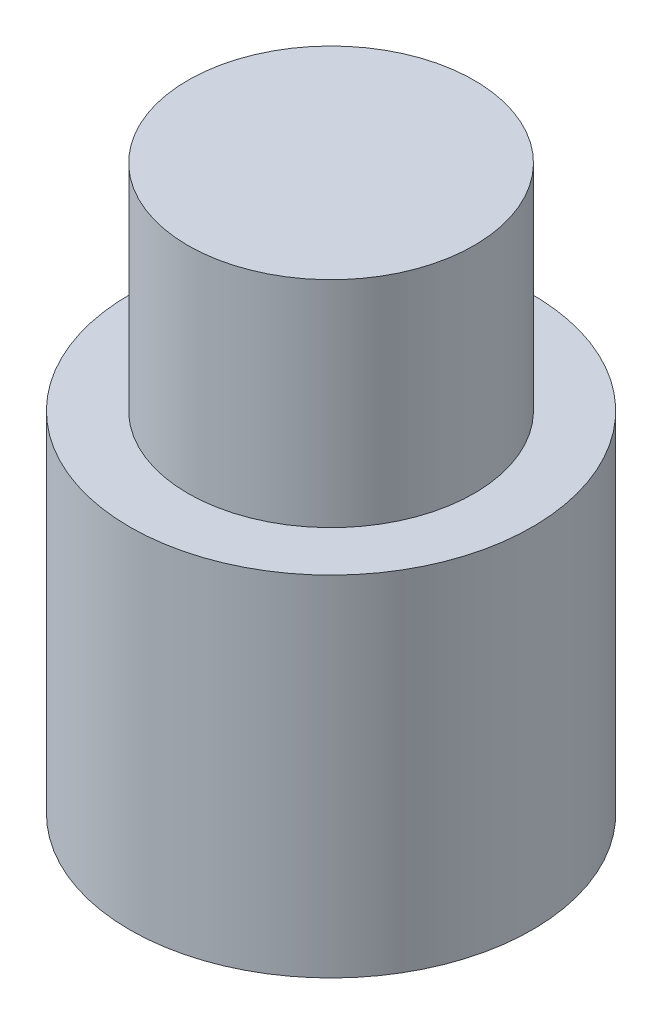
from build123d import *


with BuildPart() as part:
    # Sketch1 → Revolve1 (revolve)
    with BuildSketch(Plane(origin=(0, 0, 0), x_dir=(0, 0, -1), z_dir=(1, 0, 0)), mode=Mode.PRIVATE) as revolve1_sk:
        Polygon((203.2, 400.05), (203.2, 95.25), (285.75, 95.25), (285.75, -400.05), (203.2, -400.05), (0, -400.05), (0, 400.05), align=None)
    revolve(revolve1_sk.sketch.rotate(Axis((0, 345.62221647, 0), (0, -1, 0)), 180), axis=Axis((0, 345.62221647, 0), (0, -1, 0)))


solid = part.part
